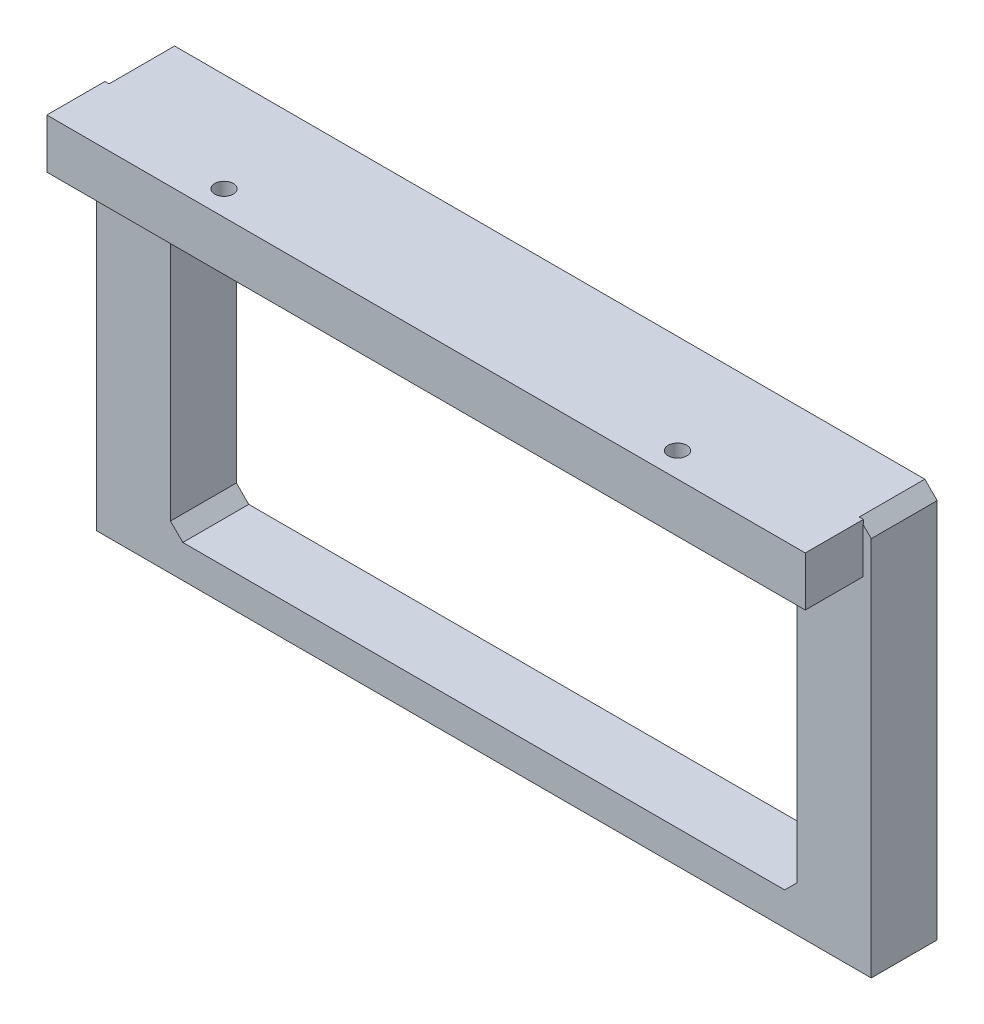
ISO-10303-21;
HEADER;
FILE_DESCRIPTION(('STEP AP214'),'2;1');
FILE_NAME('part.step','',(''),(''),'','','');
FILE_SCHEMA(('AUTOMOTIVE_DESIGN { 1 0 10303 214 1 1 1 1 }'));
ENDSEC;
DATA;
#1=APPLICATION_CONTEXT('core data for automotive mechanical design processes');
#2=APPLICATION_PROTOCOL_DEFINITION('international standard','automotive_design',2000,#1);
#3=PRODUCT_CONTEXT('',#1,'mechanical');
#4=PRODUCT('Part','Part','',(#3));
#5=PRODUCT_RELATED_PRODUCT_CATEGORY('part','',(#4));
#6=PRODUCT_DEFINITION_FORMATION('','',#4);
#7=PRODUCT_DEFINITION_CONTEXT('part definition',#1,'design');
#8=PRODUCT_DEFINITION('design','',#6,#7);
#9=PRODUCT_DEFINITION_SHAPE('','',#8);
#10=(LENGTH_UNIT() NAMED_UNIT(*) SI_UNIT(.MILLI.,.METRE.));
#11=(NAMED_UNIT(*) PLANE_ANGLE_UNIT() SI_UNIT($,.RADIAN.));
#12=(NAMED_UNIT(*) SI_UNIT($,.STERADIAN.) SOLID_ANGLE_UNIT());
#13=UNCERTAINTY_MEASURE_WITH_UNIT(LENGTH_MEASURE(1.E-05),#10,'distance_accuracy_value','');
#14=(GEOMETRIC_REPRESENTATION_CONTEXT(3) GLOBAL_UNCERTAINTY_ASSIGNED_CONTEXT((#13)) GLOBAL_UNIT_ASSIGNED_CONTEXT((#10,
#11,#12)) REPRESENTATION_CONTEXT('',''));
#15=CARTESIAN_POINT('',(0.,0.,0.));
#16=DIRECTION('',(0.,0.,1.));
#17=DIRECTION('',(1.,0.,0.));
#18=AXIS2_PLACEMENT_3D('',#15,#16,#17);
#19=CARTESIAN_POINT('',(94.,92.3,16.));
#20=DIRECTION('',(-0.707106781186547,-0.707106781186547,0.));
#21=DIRECTION('',(0.707106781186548,-0.707106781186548,0.));
#22=AXIS2_PLACEMENT_3D('',#19,#20,#21);
#23=PLANE('',#22);
#24=DIRECTION('',(0.,0.,-1.));
#25=VECTOR('',#24,1.);
#26=CARTESIAN_POINT('',(92.,94.3,16.));
#27=LINE('',#26,#25);
#28=CARTESIAN_POINT('',(92.,94.3,16.));
#29=VERTEX_POINT('',#28);
#30=CARTESIAN_POINT('',(92.,94.3,15.9));
#31=VERTEX_POINT('',#30);
#32=EDGE_CURVE('E11',#29,#31,#27,.T.);
#33=ORIENTED_EDGE('',*,*,#32,.F.);
#34=DIRECTION('',(-0.707106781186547,0.707106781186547,0.));
#35=VECTOR('',#34,1.);
#36=CARTESIAN_POINT('',(94.,92.3,16.));
#37=LINE('',#36,#35);
#38=CARTESIAN_POINT('',(94.,92.3,16.));
#39=VERTEX_POINT('',#38);
#40=EDGE_CURVE('E292',#39,#29,#37,.T.);
#41=ORIENTED_EDGE('',*,*,#40,.F.);
#42=DIRECTION('',(0.,0.,-1.));
#43=VECTOR('',#42,1.);
#44=CARTESIAN_POINT('',(94.,92.3,16.));
#45=LINE('',#44,#43);
#46=CARTESIAN_POINT('',(94.,92.3,0.));
#47=VERTEX_POINT('',#46);
#48=EDGE_CURVE('E316',#39,#47,#45,.T.);
#49=ORIENTED_EDGE('',*,*,#48,.T.);
#50=DIRECTION('',(-0.707106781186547,0.707106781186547,0.));
#51=VECTOR('',#50,1.);
#52=CARTESIAN_POINT('',(94.,92.3,0.));
#53=LINE('',#52,#51);
#54=CARTESIAN_POINT('',(91.,95.3,0.));
#55=VERTEX_POINT('',#54);
#56=EDGE_CURVE('E303',#47,#55,#53,.T.);
#57=ORIENTED_EDGE('',*,*,#56,.T.);
#58=DIRECTION('',(0.,0.,-1.));
#59=VECTOR('',#58,1.);
#60=CARTESIAN_POINT('',(91.,95.3,16.));
#61=LINE('',#60,#59);
#62=CARTESIAN_POINT('',(91.,95.3,15.9));
#63=VERTEX_POINT('',#62);
#64=EDGE_CURVE('E314',#63,#55,#61,.T.);
#65=ORIENTED_EDGE('',*,*,#64,.F.);
#66=DIRECTION('',(-0.707106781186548,0.707106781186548,0.));
#67=VECTOR('',#66,1.);
#68=CARTESIAN_POINT('',(94.,92.3,15.9));
#69=LINE('',#68,#67);
#70=EDGE_CURVE('E219',#31,#63,#69,.T.);
#71=ORIENTED_EDGE('',*,*,#70,.F.);
#72=EDGE_LOOP('',(#33,#41,#49,#57,#65,#71));
#73=FACE_BOUND('',#72,.T.);
#74=ADVANCED_FACE('F43',(#73),#23,.F.);
#75=CARTESIAN_POINT('',(-91.,95.3,16.));
#76=DIRECTION('',(0.707106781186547,-0.707106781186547,0.));
#77=DIRECTION('',(0.707106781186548,0.707106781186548,0.));
#78=AXIS2_PLACEMENT_3D('',#75,#76,#77);
#79=PLANE('',#78);
#80=DIRECTION('',(0.,0.,1.));
#81=VECTOR('',#80,1.);
#82=CARTESIAN_POINT('',(-92.,94.3,16.));
#83=LINE('',#82,#81);
#84=CARTESIAN_POINT('',(-92.,94.3,15.9));
#85=VERTEX_POINT('',#84);
#86=CARTESIAN_POINT('',(-92.,94.3,16.));
#87=VERTEX_POINT('',#86);
#88=EDGE_CURVE('E51',#85,#87,#83,.T.);
#89=ORIENTED_EDGE('',*,*,#88,.F.);
#90=DIRECTION('',(-0.707106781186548,-0.707106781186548,0.));
#91=VECTOR('',#90,1.);
#92=CARTESIAN_POINT('',(-91.,95.3,15.9));
#93=LINE('',#92,#91);
#94=CARTESIAN_POINT('',(-91.,95.3,15.9));
#95=VERTEX_POINT('',#94);
#96=EDGE_CURVE('E216',#95,#85,#93,.T.);
#97=ORIENTED_EDGE('',*,*,#96,.F.);
#98=DIRECTION('',(0.,0.,-1.));
#99=VECTOR('',#98,1.);
#100=CARTESIAN_POINT('',(-91.,95.3,16.));
#101=LINE('',#100,#99);
#102=CARTESIAN_POINT('',(-91.,95.3,0.));
#103=VERTEX_POINT('',#102);
#104=EDGE_CURVE('E312',#95,#103,#101,.T.);
#105=ORIENTED_EDGE('',*,*,#104,.T.);
#106=DIRECTION('',(-0.707106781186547,-0.707106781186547,0.));
#107=VECTOR('',#106,1.);
#108=CARTESIAN_POINT('',(-91.,95.3,0.));
#109=LINE('',#108,#107);
#110=CARTESIAN_POINT('',(-94.,92.3,0.));
#111=VERTEX_POINT('',#110);
#112=EDGE_CURVE('E288',#103,#111,#109,.T.);
#113=ORIENTED_EDGE('',*,*,#112,.T.);
#114=DIRECTION('',(0.,0.,-1.));
#115=VECTOR('',#114,1.);
#116=CARTESIAN_POINT('',(-94.,92.3,16.));
#117=LINE('',#116,#115);
#118=CARTESIAN_POINT('',(-94.,92.3,16.));
#119=VERTEX_POINT('',#118);
#120=EDGE_CURVE('E296',#119,#111,#117,.T.);
#121=ORIENTED_EDGE('',*,*,#120,.F.);
#122=DIRECTION('',(-0.707106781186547,-0.707106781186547,0.));
#123=VECTOR('',#122,1.);
#124=CARTESIAN_POINT('',(-91.,95.3,16.));
#125=LINE('',#124,#123);
#126=EDGE_CURVE('E294',#87,#119,#125,.T.);
#127=ORIENTED_EDGE('',*,*,#126,.F.);
#128=EDGE_LOOP('',(#89,#97,#105,#113,#121,#127));
#129=FACE_BOUND('',#128,.T.);
#130=ADVANCED_FACE('F328',(#129),#79,.F.);
#131=CARTESIAN_POINT('',(0.,0.,16.));
#132=DIRECTION('',(0.,0.,1.));
#133=DIRECTION('',(1.,0.,0.));
#134=AXIS2_PLACEMENT_3D('',#131,#132,#133);
#135=PLANE('',#134);
#136=DIRECTION('',(1.,0.,0.));
#137=VECTOR('',#136,1.);
#138=CARTESIAN_POINT('',(0.,83.3,16.));
#139=LINE('',#138,#137);
#140=CARTESIAN_POINT('',(-92.,83.3,16.));
#141=VERTEX_POINT('',#140);
#142=CARTESIAN_POINT('',(-73.,83.3,16.));
#143=VERTEX_POINT('',#142);
#144=EDGE_CURVE('E58',#141,#143,#139,.T.);
#145=ORIENTED_EDGE('',*,*,#144,.F.);
#146=DIRECTION('',(0.,1.,0.));
#147=VECTOR('',#146,1.);
#148=CARTESIAN_POINT('',(-92.,0.,16.));
#149=LINE('',#148,#147);
#150=EDGE_CURVE('E222',#141,#87,#149,.T.);
#151=ORIENTED_EDGE('',*,*,#150,.T.);
#152=ORIENTED_EDGE('',*,*,#126,.T.);
#153=DIRECTION('',(0.,-1.,0.));
#154=VECTOR('',#153,1.);
#155=CARTESIAN_POINT('',(-94.,92.3,16.));
#156=LINE('',#155,#154);
#157=CARTESIAN_POINT('',(-94.,0.,16.));
#158=VERTEX_POINT('',#157);
#159=EDGE_CURVE('E284',#119,#158,#156,.T.);
#160=ORIENTED_EDGE('',*,*,#159,.T.);
#161=DIRECTION('',(1.,0.,0.));
#162=VECTOR('',#161,1.);
#163=CARTESIAN_POINT('',(-94.,0.,16.));
#164=LINE('',#163,#162);
#165=CARTESIAN_POINT('',(94.,0.,16.));
#166=VERTEX_POINT('',#165);
#167=EDGE_CURVE('E287',#158,#166,#164,.T.);
#168=ORIENTED_EDGE('',*,*,#167,.T.);
#169=DIRECTION('',(0.,1.,0.));
#170=VECTOR('',#169,1.);
#171=CARTESIAN_POINT('',(94.,0.,16.));
#172=LINE('',#171,#170);
#173=EDGE_CURVE('E290',#166,#39,#172,.T.);
#174=ORIENTED_EDGE('',*,*,#173,.T.);
#175=ORIENTED_EDGE('',*,*,#40,.T.);
#176=DIRECTION('',(0.,-1.,0.));
#177=VECTOR('',#176,1.);
#178=CARTESIAN_POINT('',(92.,0.,16.));
#179=LINE('',#178,#177);
#180=CARTESIAN_POINT('',(92.,83.3,16.));
#181=VERTEX_POINT('',#180);
#182=EDGE_CURVE('E65',#29,#181,#179,.T.);
#183=ORIENTED_EDGE('',*,*,#182,.T.);
#184=CARTESIAN_POINT('',(73.,83.3,16.));
#185=VERTEX_POINT('',#184);
#186=EDGE_CURVE('E209',#185,#181,#139,.T.);
#187=ORIENTED_EDGE('',*,*,#186,.F.);
#188=DIRECTION('',(-0.707106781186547,0.707106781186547,0.));
#189=VECTOR('',#188,1.);
#190=CARTESIAN_POINT('',(76.,80.3,16.));
#191=LINE('',#190,#189);
#192=CARTESIAN_POINT('',(76.,80.3,16.));
#193=VERTEX_POINT('',#192);
#194=EDGE_CURVE('E235',#193,#185,#191,.T.);
#195=ORIENTED_EDGE('',*,*,#194,.F.);
#196=DIRECTION('',(0.,1.,0.));
#197=VECTOR('',#196,1.);
#198=CARTESIAN_POINT('',(76.,11.,16.));
#199=LINE('',#198,#197);
#200=CARTESIAN_POINT('',(76.,11.,16.));
#201=VERTEX_POINT('',#200);
#202=EDGE_CURVE('E233',#201,#193,#199,.T.);
#203=ORIENTED_EDGE('',*,*,#202,.F.);
#204=DIRECTION('',(0.707106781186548,0.707106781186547,0.));
#205=VECTOR('',#204,1.);
#206=CARTESIAN_POINT('',(73.,8.,16.));
#207=LINE('',#206,#205);
#208=CARTESIAN_POINT('',(73.,8.,16.));
#209=VERTEX_POINT('',#208);
#210=EDGE_CURVE('E231',#209,#201,#207,.T.);
#211=ORIENTED_EDGE('',*,*,#210,.F.);
#212=DIRECTION('',(1.,0.,0.));
#213=VECTOR('',#212,1.);
#214=CARTESIAN_POINT('',(-73.,8.,16.));
#215=LINE('',#214,#213);
#216=CARTESIAN_POINT('',(-73.,8.,16.));
#217=VERTEX_POINT('',#216);
#218=EDGE_CURVE('E228',#217,#209,#215,.T.);
#219=ORIENTED_EDGE('',*,*,#218,.F.);
#220=DIRECTION('',(0.707106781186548,-0.707106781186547,0.));
#221=VECTOR('',#220,1.);
#222=CARTESIAN_POINT('',(-76.,11.,16.));
#223=LINE('',#222,#221);
#224=CARTESIAN_POINT('',(-76.,11.,16.));
#225=VERTEX_POINT('',#224);
#226=EDGE_CURVE('E226',#225,#217,#223,.T.);
#227=ORIENTED_EDGE('',*,*,#226,.F.);
#228=DIRECTION('',(0.,-1.,0.));
#229=VECTOR('',#228,1.);
#230=CARTESIAN_POINT('',(-76.,80.3,16.));
#231=LINE('',#230,#229);
#232=CARTESIAN_POINT('',(-76.,80.3,16.));
#233=VERTEX_POINT('',#232);
#234=EDGE_CURVE('E241',#233,#225,#231,.T.);
#235=ORIENTED_EDGE('',*,*,#234,.F.);
#236=DIRECTION('',(-0.707106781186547,-0.707106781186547,0.));
#237=VECTOR('',#236,1.);
#238=CARTESIAN_POINT('',(-73.,83.3,16.));
#239=LINE('',#238,#237);
#240=EDGE_CURVE('E238',#143,#233,#239,.T.);
#241=ORIENTED_EDGE('',*,*,#240,.F.);
#242=EDGE_LOOP('',(#145,#151,#152,#160,#168,#174,#175,#183,#187,#195,#203,#211,#219,#227,#235,#241));
#243=FACE_BOUND('',#242,.T.);
#244=ADVANCED_FACE('F351',(#243),#135,.T.);
#245=CARTESIAN_POINT('',(0.,0.,0.));
#246=DIRECTION('',(0.,0.,1.));
#247=DIRECTION('',(1.,0.,0.));
#248=AXIS2_PLACEMENT_3D('',#245,#246,#247);
#249=PLANE('',#248);
#250=DIRECTION('',(0.,-1.,0.));
#251=VECTOR('',#250,1.);
#252=CARTESIAN_POINT('',(-94.,92.3,0.));
#253=LINE('',#252,#251);
#254=CARTESIAN_POINT('',(-94.,0.,0.));
#255=VERTEX_POINT('',#254);
#256=EDGE_CURVE('E283',#111,#255,#253,.T.);
#257=ORIENTED_EDGE('',*,*,#256,.F.);
#258=ORIENTED_EDGE('',*,*,#112,.F.);
#259=DIRECTION('',(-1.,0.,0.));
#260=VECTOR('',#259,1.);
#261=CARTESIAN_POINT('',(91.,95.3,0.));
#262=LINE('',#261,#260);
#263=EDGE_CURVE('E306',#55,#103,#262,.T.);
#264=ORIENTED_EDGE('',*,*,#263,.F.);
#265=ORIENTED_EDGE('',*,*,#56,.F.);
#266=DIRECTION('',(0.,1.,0.));
#267=VECTOR('',#266,1.);
#268=CARTESIAN_POINT('',(94.,0.,0.));
#269=LINE('',#268,#267);
#270=CARTESIAN_POINT('',(94.,0.,0.));
#271=VERTEX_POINT('',#270);
#272=EDGE_CURVE('E301',#271,#47,#269,.T.);
#273=ORIENTED_EDGE('',*,*,#272,.F.);
#274=DIRECTION('',(1.,0.,0.));
#275=VECTOR('',#274,1.);
#276=CARTESIAN_POINT('',(-94.,0.,0.));
#277=LINE('',#276,#275);
#278=EDGE_CURVE('E299',#255,#271,#277,.T.);
#279=ORIENTED_EDGE('',*,*,#278,.F.);
#280=EDGE_LOOP('',(#257,#258,#264,#265,#273,#279));
#281=FACE_BOUND('',#280,.T.);
#282=DIRECTION('',(0.707106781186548,-0.707106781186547,0.));
#283=VECTOR('',#282,1.);
#284=CARTESIAN_POINT('',(-76.,11.,0.));
#285=LINE('',#284,#283);
#286=CARTESIAN_POINT('',(-76.,11.,0.));
#287=VERTEX_POINT('',#286);
#288=CARTESIAN_POINT('',(-73.,8.,0.));
#289=VERTEX_POINT('',#288);
#290=EDGE_CURVE('E225',#287,#289,#285,.T.);
#291=ORIENTED_EDGE('',*,*,#290,.T.);
#292=DIRECTION('',(1.,0.,0.));
#293=VECTOR('',#292,1.);
#294=CARTESIAN_POINT('',(-73.,8.,0.));
#295=LINE('',#294,#293);
#296=CARTESIAN_POINT('',(73.,8.,0.));
#297=VERTEX_POINT('',#296);
#298=EDGE_CURVE('E246',#289,#297,#295,.T.);
#299=ORIENTED_EDGE('',*,*,#298,.T.);
#300=DIRECTION('',(0.707106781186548,0.707106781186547,0.));
#301=VECTOR('',#300,1.);
#302=CARTESIAN_POINT('',(73.,8.,0.));
#303=LINE('',#302,#301);
#304=CARTESIAN_POINT('',(76.,11.,0.));
#305=VERTEX_POINT('',#304);
#306=EDGE_CURVE('E249',#297,#305,#303,.T.);
#307=ORIENTED_EDGE('',*,*,#306,.T.);
#308=DIRECTION('',(0.,1.,0.));
#309=VECTOR('',#308,1.);
#310=CARTESIAN_POINT('',(76.,11.,0.));
#311=LINE('',#310,#309);
#312=CARTESIAN_POINT('',(76.,80.3,0.));
#313=VERTEX_POINT('',#312);
#314=EDGE_CURVE('E252',#305,#313,#311,.T.);
#315=ORIENTED_EDGE('',*,*,#314,.T.);
#316=DIRECTION('',(-0.707106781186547,0.707106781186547,0.));
#317=VECTOR('',#316,1.);
#318=CARTESIAN_POINT('',(76.,80.3,0.));
#319=LINE('',#318,#317);
#320=CARTESIAN_POINT('',(73.,83.3,0.));
#321=VERTEX_POINT('',#320);
#322=EDGE_CURVE('E255',#313,#321,#319,.T.);
#323=ORIENTED_EDGE('',*,*,#322,.T.);
#324=DIRECTION('',(-1.,0.,0.));
#325=VECTOR('',#324,1.);
#326=CARTESIAN_POINT('',(73.,83.3,0.));
#327=LINE('',#326,#325);
#328=CARTESIAN_POINT('',(-73.,83.3,0.));
#329=VERTEX_POINT('',#328);
#330=EDGE_CURVE('E258',#321,#329,#327,.T.);
#331=ORIENTED_EDGE('',*,*,#330,.T.);
#332=DIRECTION('',(-0.707106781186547,-0.707106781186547,0.));
#333=VECTOR('',#332,1.);
#334=CARTESIAN_POINT('',(-73.,83.3,0.));
#335=LINE('',#334,#333);
#336=CARTESIAN_POINT('',(-76.,80.3,0.));
#337=VERTEX_POINT('',#336);
#338=EDGE_CURVE('E261',#329,#337,#335,.T.);
#339=ORIENTED_EDGE('',*,*,#338,.T.);
#340=DIRECTION('',(0.,-1.,0.));
#341=VECTOR('',#340,1.);
#342=CARTESIAN_POINT('',(-76.,80.3,0.));
#343=LINE('',#342,#341);
#344=EDGE_CURVE('E229',#337,#287,#343,.T.);
#345=ORIENTED_EDGE('',*,*,#344,.T.);
#346=EDGE_LOOP('',(#291,#299,#307,#315,#323,#331,#339,#345));
#347=FACE_BOUND('',#346,.T.);
#348=ADVANCED_FACE('F362',(#281,#347),#249,.F.);
#349=CARTESIAN_POINT('',(-94.,92.3,16.));
#350=DIRECTION('',(1.,0.,0.));
#351=DIRECTION('',(0.,0.,-1.));
#352=AXIS2_PLACEMENT_3D('',#349,#350,#351);
#353=PLANE('',#352);
#354=ORIENTED_EDGE('',*,*,#256,.T.);
#355=DIRECTION('',(0.,0.,-1.));
#356=VECTOR('',#355,1.);
#357=CARTESIAN_POINT('',(-94.,0.,16.));
#358=LINE('',#357,#356);
#359=EDGE_CURVE('E322',#158,#255,#358,.T.);
#360=ORIENTED_EDGE('',*,*,#359,.F.);
#361=ORIENTED_EDGE('',*,*,#159,.F.);
#362=ORIENTED_EDGE('',*,*,#120,.T.);
#363=EDGE_LOOP('',(#354,#360,#361,#362));
#364=FACE_BOUND('',#363,.T.);
#365=ADVANCED_FACE('F45',(#364),#353,.F.);
#366=CARTESIAN_POINT('',(-94.,0.,16.));
#367=DIRECTION('',(0.,1.,0.));
#368=DIRECTION('',(0.,0.,1.));
#369=AXIS2_PLACEMENT_3D('',#366,#367,#368);
#370=PLANE('',#369);
#371=ORIENTED_EDGE('',*,*,#278,.T.);
#372=DIRECTION('',(0.,0.,-1.));
#373=VECTOR('',#372,1.);
#374=CARTESIAN_POINT('',(94.,0.,16.));
#375=LINE('',#374,#373);
#376=EDGE_CURVE('E319',#166,#271,#375,.T.);
#377=ORIENTED_EDGE('',*,*,#376,.F.);
#378=ORIENTED_EDGE('',*,*,#167,.F.);
#379=ORIENTED_EDGE('',*,*,#359,.T.);
#380=EDGE_LOOP('',(#371,#377,#378,#379));
#381=FACE_BOUND('',#380,.T.);
#382=ADVANCED_FACE('F369',(#381),#370,.F.);
#383=CARTESIAN_POINT('',(94.,0.,16.));
#384=DIRECTION('',(-1.,0.,0.));
#385=DIRECTION('',(0.,0.,1.));
#386=AXIS2_PLACEMENT_3D('',#383,#384,#385);
#387=PLANE('',#386);
#388=ORIENTED_EDGE('',*,*,#272,.T.);
#389=ORIENTED_EDGE('',*,*,#48,.F.);
#390=ORIENTED_EDGE('',*,*,#173,.F.);
#391=ORIENTED_EDGE('',*,*,#376,.T.);
#392=EDGE_LOOP('',(#388,#389,#390,#391));
#393=FACE_BOUND('',#392,.T.);
#394=ADVANCED_FACE('F356',(#393),#387,.F.);
#395=CARTESIAN_POINT('',(91.,95.3,16.));
#396=DIRECTION('',(0.,-1.,0.));
#397=DIRECTION('',(0.,0.,-1.));
#398=AXIS2_PLACEMENT_3D('',#395,#396,#397);
#399=PLANE('',#398);
#400=DIRECTION('',(-1.,0.,0.));
#401=VECTOR('',#400,1.);
#402=CARTESIAN_POINT('',(-92.,95.3,15.9));
#403=LINE('',#402,#401);
#404=CARTESIAN_POINT('',(92.,95.3,15.9));
#405=VERTEX_POINT('',#404);
#406=EDGE_CURVE('E332',#405,#63,#403,.T.);
#407=ORIENTED_EDGE('',*,*,#406,.T.);
#408=ORIENTED_EDGE('',*,*,#64,.T.);
#409=ORIENTED_EDGE('',*,*,#263,.T.);
#410=ORIENTED_EDGE('',*,*,#104,.F.);
#411=CARTESIAN_POINT('',(-92.,95.3,15.9));
#412=VERTEX_POINT('',#411);
#413=EDGE_CURVE('E199',#95,#412,#403,.T.);
#414=ORIENTED_EDGE('',*,*,#413,.T.);
#415=DIRECTION('',(0.,0.,1.));
#416=VECTOR('',#415,1.);
#417=CARTESIAN_POINT('',(-92.,95.3,30.));
#418=LINE('',#417,#416);
#419=CARTESIAN_POINT('',(-92.,95.3,30.));
#420=VERTEX_POINT('',#419);
#421=EDGE_CURVE('E191',#412,#420,#418,.T.);
#422=ORIENTED_EDGE('',*,*,#421,.T.);
#423=DIRECTION('',(1.,0.,0.));
#424=VECTOR('',#423,1.);
#425=CARTESIAN_POINT('',(92.,95.3,30.));
#426=LINE('',#425,#424);
#427=CARTESIAN_POINT('',(92.,95.3,30.));
#428=VERTEX_POINT('',#427);
#429=EDGE_CURVE('E181',#420,#428,#426,.T.);
#430=ORIENTED_EDGE('',*,*,#429,.T.);
#431=DIRECTION('',(0.,0.,-1.));
#432=VECTOR('',#431,1.);
#433=CARTESIAN_POINT('',(92.,95.3,15.9));
#434=LINE('',#433,#432);
#435=EDGE_CURVE('E190',#428,#405,#434,.T.);
#436=ORIENTED_EDGE('',*,*,#435,.T.);
#437=EDGE_LOOP('',(#407,#408,#409,#410,#414,#422,#430,#436));
#438=FACE_BOUND('',#437,.T.);
#439=CARTESIAN_POINT('',(-55.,95.3,24.));
#440=DIRECTION('',(0.,1.,0.));
#441=DIRECTION('',(0.,0.,1.));
#442=AXIS2_PLACEMENT_3D('',#439,#440,#441);
#443=CIRCLE('',#442,2.25);
#444=CARTESIAN_POINT('',(-55.,95.3,26.25));
#445=VERTEX_POINT('',#444);
#446=EDGE_CURVE('E338',#445,#445,#443,.T.);
#447=ORIENTED_EDGE('',*,*,#446,.F.);
#448=EDGE_LOOP('',(#447));
#449=FACE_BOUND('',#448,.T.);
#450=CARTESIAN_POINT('',(55.,95.3,24.));
#451=DIRECTION('',(0.,1.,0.));
#452=DIRECTION('',(0.,0.,1.));
#453=AXIS2_PLACEMENT_3D('',#450,#451,#452);
#454=CIRCLE('',#453,2.25);
#455=CARTESIAN_POINT('',(55.,95.3,26.25));
#456=VERTEX_POINT('',#455);
#457=EDGE_CURVE('E441',#456,#456,#454,.T.);
#458=ORIENTED_EDGE('',*,*,#457,.F.);
#459=EDGE_LOOP('',(#458));
#460=FACE_BOUND('',#459,.T.);
#461=ADVANCED_FACE('F195',(#438,#449,#460),#399,.F.);
#462=CARTESIAN_POINT('',(-76.,11.,16.));
#463=DIRECTION('',(0.707106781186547,0.707106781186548,0.));
#464=DIRECTION('',(-0.707106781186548,0.707106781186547,0.));
#465=AXIS2_PLACEMENT_3D('',#462,#463,#464);
#466=PLANE('',#465);
#467=ORIENTED_EDGE('',*,*,#290,.F.);
#468=DIRECTION('',(0.,0.,-1.));
#469=VECTOR('',#468,1.);
#470=CARTESIAN_POINT('',(-76.,11.,16.));
#471=LINE('',#470,#469);
#472=EDGE_CURVE('E243',#225,#287,#471,.T.);
#473=ORIENTED_EDGE('',*,*,#472,.F.);
#474=ORIENTED_EDGE('',*,*,#226,.T.);
#475=DIRECTION('',(0.,0.,-1.));
#476=VECTOR('',#475,1.);
#477=CARTESIAN_POINT('',(-73.,8.,16.));
#478=LINE('',#477,#476);
#479=EDGE_CURVE('E280',#217,#289,#478,.T.);
#480=ORIENTED_EDGE('',*,*,#479,.T.);
#481=EDGE_LOOP('',(#467,#473,#474,#480));
#482=FACE_BOUND('',#481,.T.);
#483=ADVANCED_FACE('F385',(#482),#466,.T.);
#484=CARTESIAN_POINT('',(-73.,8.,16.));
#485=DIRECTION('',(0.,1.,0.));
#486=DIRECTION('',(0.,0.,1.));
#487=AXIS2_PLACEMENT_3D('',#484,#485,#486);
#488=PLANE('',#487);
#489=ORIENTED_EDGE('',*,*,#298,.F.);
#490=ORIENTED_EDGE('',*,*,#479,.F.);
#491=ORIENTED_EDGE('',*,*,#218,.T.);
#492=DIRECTION('',(0.,0.,-1.));
#493=VECTOR('',#492,1.);
#494=CARTESIAN_POINT('',(73.,8.,16.));
#495=LINE('',#494,#493);
#496=EDGE_CURVE('E278',#209,#297,#495,.T.);
#497=ORIENTED_EDGE('',*,*,#496,.T.);
#498=EDGE_LOOP('',(#489,#490,#491,#497));
#499=FACE_BOUND('',#498,.T.);
#500=ADVANCED_FACE('F393',(#499),#488,.T.);
#501=CARTESIAN_POINT('',(73.,8.,16.));
#502=DIRECTION('',(-0.707106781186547,0.707106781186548,0.));
#503=DIRECTION('',(-0.707106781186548,-0.707106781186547,0.));
#504=AXIS2_PLACEMENT_3D('',#501,#502,#503);
#505=PLANE('',#504);
#506=ORIENTED_EDGE('',*,*,#306,.F.);
#507=ORIENTED_EDGE('',*,*,#496,.F.);
#508=ORIENTED_EDGE('',*,*,#210,.T.);
#509=DIRECTION('',(0.,0.,-1.));
#510=VECTOR('',#509,1.);
#511=CARTESIAN_POINT('',(76.,11.,16.));
#512=LINE('',#511,#510);
#513=EDGE_CURVE('E276',#201,#305,#512,.T.);
#514=ORIENTED_EDGE('',*,*,#513,.T.);
#515=EDGE_LOOP('',(#506,#507,#508,#514));
#516=FACE_BOUND('',#515,.T.);
#517=ADVANCED_FACE('F397',(#516),#505,.T.);
#518=CARTESIAN_POINT('',(76.,11.,16.));
#519=DIRECTION('',(-1.,0.,0.));
#520=DIRECTION('',(0.,0.,1.));
#521=AXIS2_PLACEMENT_3D('',#518,#519,#520);
#522=PLANE('',#521);
#523=ORIENTED_EDGE('',*,*,#314,.F.);
#524=ORIENTED_EDGE('',*,*,#513,.F.);
#525=ORIENTED_EDGE('',*,*,#202,.T.);
#526=DIRECTION('',(0.,0.,-1.));
#527=VECTOR('',#526,1.);
#528=CARTESIAN_POINT('',(76.,80.3,16.));
#529=LINE('',#528,#527);
#530=EDGE_CURVE('E274',#193,#313,#529,.T.);
#531=ORIENTED_EDGE('',*,*,#530,.T.);
#532=EDGE_LOOP('',(#523,#524,#525,#531));
#533=FACE_BOUND('',#532,.T.);
#534=ADVANCED_FACE('F401',(#533),#522,.T.);
#535=CARTESIAN_POINT('',(76.,80.3,16.));
#536=DIRECTION('',(-0.707106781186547,-0.707106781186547,0.));
#537=DIRECTION('',(0.707106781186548,-0.707106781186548,0.));
#538=AXIS2_PLACEMENT_3D('',#535,#536,#537);
#539=PLANE('',#538);
#540=ORIENTED_EDGE('',*,*,#322,.F.);
#541=ORIENTED_EDGE('',*,*,#530,.F.);
#542=ORIENTED_EDGE('',*,*,#194,.T.);
#543=DIRECTION('',(0.,0.,-1.));
#544=VECTOR('',#543,1.);
#545=CARTESIAN_POINT('',(73.,83.3,16.));
#546=LINE('',#545,#544);
#547=EDGE_CURVE('E272',#185,#321,#546,.T.);
#548=ORIENTED_EDGE('',*,*,#547,.T.);
#549=EDGE_LOOP('',(#540,#541,#542,#548));
#550=FACE_BOUND('',#549,.T.);
#551=ADVANCED_FACE('F405',(#550),#539,.T.);
#552=CARTESIAN_POINT('',(73.,83.3,16.));
#553=DIRECTION('',(0.,-1.,0.));
#554=DIRECTION('',(0.,0.,-1.));
#555=AXIS2_PLACEMENT_3D('',#552,#553,#554);
#556=PLANE('',#555);
#557=DIRECTION('',(0.,0.,-1.));
#558=VECTOR('',#557,1.);
#559=CARTESIAN_POINT('',(-73.,83.3,16.));
#560=LINE('',#559,#558);
#561=EDGE_CURVE('E270',#143,#329,#560,.T.);
#562=ORIENTED_EDGE('',*,*,#561,.T.);
#563=ORIENTED_EDGE('',*,*,#330,.F.);
#564=ORIENTED_EDGE('',*,*,#547,.F.);
#565=ORIENTED_EDGE('',*,*,#186,.T.);
#566=DIRECTION('',(0.,0.,-1.));
#567=VECTOR('',#566,1.);
#568=CARTESIAN_POINT('',(92.,83.3,15.9));
#569=LINE('',#568,#567);
#570=CARTESIAN_POINT('',(92.,83.3,30.));
#571=VERTEX_POINT('',#570);
#572=EDGE_CURVE('E203',#571,#181,#569,.T.);
#573=ORIENTED_EDGE('',*,*,#572,.F.);
#574=DIRECTION('',(1.,0.,0.));
#575=VECTOR('',#574,1.);
#576=CARTESIAN_POINT('',(92.,83.3,30.));
#577=LINE('',#576,#575);
#578=CARTESIAN_POINT('',(-92.,83.3,30.));
#579=VERTEX_POINT('',#578);
#580=EDGE_CURVE('E337',#579,#571,#577,.T.);
#581=ORIENTED_EDGE('',*,*,#580,.F.);
#582=DIRECTION('',(0.,0.,1.));
#583=VECTOR('',#582,1.);
#584=CARTESIAN_POINT('',(-92.,83.3,30.));
#585=LINE('',#584,#583);
#586=EDGE_CURVE('E207',#141,#579,#585,.T.);
#587=ORIENTED_EDGE('',*,*,#586,.F.);
#588=ORIENTED_EDGE('',*,*,#144,.T.);
#589=EDGE_LOOP('',(#562,#563,#564,#565,#573,#581,#587,#588));
#590=FACE_BOUND('',#589,.T.);
#591=CARTESIAN_POINT('',(55.,83.3,24.));
#592=DIRECTION('',(0.,1.,0.));
#593=DIRECTION('',(0.,0.,1.));
#594=AXIS2_PLACEMENT_3D('',#591,#592,#593);
#595=CIRCLE('',#594,2.25);
#596=CARTESIAN_POINT('',(55.,83.3,26.25));
#597=VERTEX_POINT('',#596);
#598=EDGE_CURVE('E444',#597,#597,#595,.T.);
#599=ORIENTED_EDGE('',*,*,#598,.T.);
#600=EDGE_LOOP('',(#599));
#601=FACE_BOUND('',#600,.T.);
#602=CARTESIAN_POINT('',(-55.,83.3,24.));
#603=DIRECTION('',(0.,1.,0.));
#604=DIRECTION('',(0.,0.,1.));
#605=AXIS2_PLACEMENT_3D('',#602,#603,#604);
#606=CIRCLE('',#605,2.25);
#607=CARTESIAN_POINT('',(-55.,83.3,26.25));
#608=VERTEX_POINT('',#607);
#609=EDGE_CURVE('E447',#608,#608,#606,.T.);
#610=ORIENTED_EDGE('',*,*,#609,.T.);
#611=EDGE_LOOP('',(#610));
#612=FACE_BOUND('',#611,.T.);
#613=ADVANCED_FACE('F409',(#590,#601,#612),#556,.T.);
#614=CARTESIAN_POINT('',(-73.,83.3,16.));
#615=DIRECTION('',(0.707106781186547,-0.707106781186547,0.));
#616=DIRECTION('',(0.707106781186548,0.707106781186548,0.));
#617=AXIS2_PLACEMENT_3D('',#614,#615,#616);
#618=PLANE('',#617);
#619=ORIENTED_EDGE('',*,*,#338,.F.);
#620=ORIENTED_EDGE('',*,*,#561,.F.);
#621=ORIENTED_EDGE('',*,*,#240,.T.);
#622=DIRECTION('',(0.,0.,-1.));
#623=VECTOR('',#622,1.);
#624=CARTESIAN_POINT('',(-76.,80.3,16.));
#625=LINE('',#624,#623);
#626=EDGE_CURVE('E268',#233,#337,#625,.T.);
#627=ORIENTED_EDGE('',*,*,#626,.T.);
#628=EDGE_LOOP('',(#619,#620,#621,#627));
#629=FACE_BOUND('',#628,.T.);
#630=ADVANCED_FACE('F413',(#629),#618,.T.);
#631=CARTESIAN_POINT('',(-76.,80.3,16.));
#632=DIRECTION('',(1.,0.,0.));
#633=DIRECTION('',(0.,0.,-1.));
#634=AXIS2_PLACEMENT_3D('',#631,#632,#633);
#635=PLANE('',#634);
#636=ORIENTED_EDGE('',*,*,#344,.F.);
#637=ORIENTED_EDGE('',*,*,#626,.F.);
#638=ORIENTED_EDGE('',*,*,#234,.T.);
#639=ORIENTED_EDGE('',*,*,#472,.T.);
#640=EDGE_LOOP('',(#636,#637,#638,#639));
#641=FACE_BOUND('',#640,.T.);
#642=ADVANCED_FACE('F417',(#641),#635,.T.);
#643=CARTESIAN_POINT('',(-92.,95.3,15.9));
#644=DIRECTION('',(0.,0.,1.));
#645=DIRECTION('',(1.,0.,0.));
#646=AXIS2_PLACEMENT_3D('',#643,#644,#645);
#647=PLANE('',#646);
#648=DIRECTION('',(0.,-1.,0.));
#649=VECTOR('',#648,1.);
#650=CARTESIAN_POINT('',(92.,95.3,15.9));
#651=LINE('',#650,#649);
#652=EDGE_CURVE('E212',#405,#31,#651,.T.);
#653=ORIENTED_EDGE('',*,*,#652,.T.);
#654=ORIENTED_EDGE('',*,*,#70,.T.);
#655=ORIENTED_EDGE('',*,*,#406,.F.);
#656=EDGE_LOOP('',(#653,#654,#655));
#657=FACE_BOUND('',#656,.T.);
#658=ADVANCED_FACE('F346',(#657),#647,.F.);
#659=ORIENTED_EDGE('',*,*,#413,.F.);
#660=ORIENTED_EDGE('',*,*,#96,.T.);
#661=DIRECTION('',(0.,-1.,0.));
#662=VECTOR('',#661,1.);
#663=CARTESIAN_POINT('',(-92.,95.3,15.9));
#664=LINE('',#663,#662);
#665=EDGE_CURVE('E325',#412,#85,#664,.T.);
#666=ORIENTED_EDGE('',*,*,#665,.F.);
#667=EDGE_LOOP('',(#659,#660,#666));
#668=FACE_BOUND('',#667,.T.);
#669=ADVANCED_FACE('F331',(#668),#647,.F.);
#670=CARTESIAN_POINT('',(-92.,95.3,30.));
#671=DIRECTION('',(1.,0.,0.));
#672=DIRECTION('',(0.,0.,-1.));
#673=AXIS2_PLACEMENT_3D('',#670,#671,#672);
#674=PLANE('',#673);
#675=ORIENTED_EDGE('',*,*,#150,.F.);
#676=ORIENTED_EDGE('',*,*,#586,.T.);
#677=DIRECTION('',(0.,-1.,0.));
#678=VECTOR('',#677,1.);
#679=CARTESIAN_POINT('',(-92.,95.3,30.));
#680=LINE('',#679,#678);
#681=EDGE_CURVE('E185',#420,#579,#680,.T.);
#682=ORIENTED_EDGE('',*,*,#681,.F.);
#683=ORIENTED_EDGE('',*,*,#421,.F.);
#684=ORIENTED_EDGE('',*,*,#665,.T.);
#685=ORIENTED_EDGE('',*,*,#88,.T.);
#686=EDGE_LOOP('',(#675,#676,#682,#683,#684,#685));
#687=FACE_BOUND('',#686,.T.);
#688=ADVANCED_FACE('F205',(#687),#674,.F.);
#689=CARTESIAN_POINT('',(92.,95.3,30.));
#690=DIRECTION('',(0.,0.,-1.));
#691=DIRECTION('',(-1.,0.,0.));
#692=AXIS2_PLACEMENT_3D('',#689,#690,#691);
#693=PLANE('',#692);
#694=ORIENTED_EDGE('',*,*,#580,.T.);
#695=DIRECTION('',(0.,-1.,0.));
#696=VECTOR('',#695,1.);
#697=CARTESIAN_POINT('',(92.,95.3,30.));
#698=LINE('',#697,#696);
#699=EDGE_CURVE('E187',#428,#571,#698,.T.);
#700=ORIENTED_EDGE('',*,*,#699,.F.);
#701=ORIENTED_EDGE('',*,*,#429,.F.);
#702=ORIENTED_EDGE('',*,*,#681,.T.);
#703=EDGE_LOOP('',(#694,#700,#701,#702));
#704=FACE_BOUND('',#703,.T.);
#705=ADVANCED_FACE('F183',(#704),#693,.F.);
#706=CARTESIAN_POINT('',(92.,95.3,15.9));
#707=DIRECTION('',(-1.,0.,0.));
#708=DIRECTION('',(0.,0.,1.));
#709=AXIS2_PLACEMENT_3D('',#706,#707,#708);
#710=PLANE('',#709);
#711=ORIENTED_EDGE('',*,*,#182,.F.);
#712=ORIENTED_EDGE('',*,*,#32,.T.);
#713=ORIENTED_EDGE('',*,*,#652,.F.);
#714=ORIENTED_EDGE('',*,*,#435,.F.);
#715=ORIENTED_EDGE('',*,*,#699,.T.);
#716=ORIENTED_EDGE('',*,*,#572,.T.);
#717=EDGE_LOOP('',(#711,#712,#713,#714,#715,#716));
#718=FACE_BOUND('',#717,.T.);
#719=ADVANCED_FACE('F348',(#718),#710,.F.);
#720=CARTESIAN_POINT('',(-55.,95.3,24.));
#721=DIRECTION('',(0.,-1.,0.));
#722=DIRECTION('',(0.,0.,-1.));
#723=AXIS2_PLACEMENT_3D('',#720,#721,#722);
#724=CYLINDRICAL_SURFACE('',#723,2.25);
#725=ORIENTED_EDGE('',*,*,#446,.T.);
#726=EDGE_LOOP('',(#725));
#727=FACE_BOUND('',#726,.T.);
#728=ORIENTED_EDGE('',*,*,#609,.F.);
#729=EDGE_LOOP('',(#728));
#730=FACE_BOUND('',#729,.T.);
#731=ADVANCED_FACE('F427',(#727,#730),#724,.F.);
#732=CARTESIAN_POINT('',(55.,95.3,24.));
#733=DIRECTION('',(0.,-1.,0.));
#734=DIRECTION('',(0.,0.,-1.));
#735=AXIS2_PLACEMENT_3D('',#732,#733,#734);
#736=CYLINDRICAL_SURFACE('',#735,2.25);
#737=ORIENTED_EDGE('',*,*,#457,.T.);
#738=EDGE_LOOP('',(#737));
#739=FACE_BOUND('',#738,.T.);
#740=ORIENTED_EDGE('',*,*,#598,.F.);
#741=EDGE_LOOP('',(#740));
#742=FACE_BOUND('',#741,.T.);
#743=ADVANCED_FACE('F432',(#739,#742),#736,.F.);
#744=CLOSED_SHELL('',(#74,#130,#244,#348,#365,#382,#394,#461,#483,#500,#517,#534,#551,#613,#630,
#642,#658,#669,#688,#705,#719,#731,#743));
#745=MANIFOLD_SOLID_BREP('B2',#744);
#746=ADVANCED_BREP_SHAPE_REPRESENTATION('',(#18,#745),#14);
#747=SHAPE_DEFINITION_REPRESENTATION(#9,#746);
ENDSEC;
END-ISO-10303-21;
